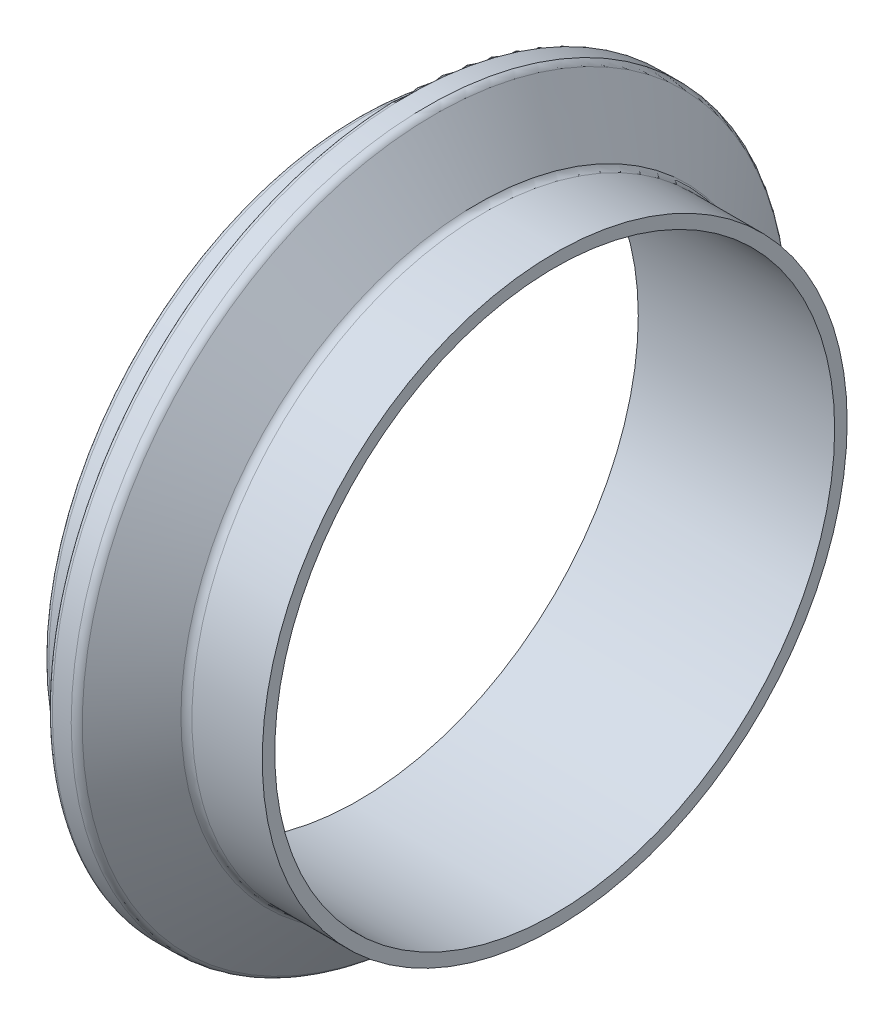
ISO-10303-21;
HEADER;
FILE_DESCRIPTION(('STEP AP214'),'2;1');
FILE_NAME('part.step','',(''),(''),'','','');
FILE_SCHEMA(('AUTOMOTIVE_DESIGN { 1 0 10303 214 1 1 1 1 }'));
ENDSEC;
DATA;
#1=APPLICATION_CONTEXT('core data for automotive mechanical design processes');
#2=APPLICATION_PROTOCOL_DEFINITION('international standard','automotive_design',2000,#1);
#3=PRODUCT_CONTEXT('',#1,'mechanical');
#4=PRODUCT('Part','Part','',(#3));
#5=PRODUCT_RELATED_PRODUCT_CATEGORY('part','',(#4));
#6=PRODUCT_DEFINITION_FORMATION('','',#4);
#7=PRODUCT_DEFINITION_CONTEXT('part definition',#1,'design');
#8=PRODUCT_DEFINITION('design','',#6,#7);
#9=PRODUCT_DEFINITION_SHAPE('','',#8);
#10=(LENGTH_UNIT() NAMED_UNIT(*) SI_UNIT(.MILLI.,.METRE.));
#11=(NAMED_UNIT(*) PLANE_ANGLE_UNIT() SI_UNIT($,.RADIAN.));
#12=(NAMED_UNIT(*) SI_UNIT($,.STERADIAN.) SOLID_ANGLE_UNIT());
#13=UNCERTAINTY_MEASURE_WITH_UNIT(LENGTH_MEASURE(1.E-05),#10,'distance_accuracy_value','');
#14=(GEOMETRIC_REPRESENTATION_CONTEXT(3) GLOBAL_UNCERTAINTY_ASSIGNED_CONTEXT((#13)) GLOBAL_UNIT_ASSIGNED_CONTEXT((#10,
#11,#12)) REPRESENTATION_CONTEXT('',''));
#15=CARTESIAN_POINT('',(0.,0.,0.));
#16=DIRECTION('',(0.,0.,1.));
#17=DIRECTION('',(1.,0.,0.));
#18=AXIS2_PLACEMENT_3D('',#15,#16,#17);
#19=CARTESIAN_POINT('',(0.,50.8,0.));
#20=DIRECTION('',(1.,0.,0.));
#21=DIRECTION('',(0.,0.,-1.));
#22=AXIS2_PLACEMENT_3D('',#19,#20,#21);
#23=PLANE('',#22);
#24=CARTESIAN_POINT('',(0.,0.,0.));
#25=DIRECTION('',(1.,0.,0.));
#26=DIRECTION('',(0.,0.,-1.));
#27=AXIS2_PLACEMENT_3D('',#24,#25,#26);
#28=CIRCLE('',#27,50.8);
#29=CARTESIAN_POINT('',(0.,0.,-50.8));
#30=VERTEX_POINT('',#29);
#31=EDGE_CURVE('E10',#30,#30,#28,.T.);
#32=ORIENTED_EDGE('',*,*,#31,.T.);
#33=EDGE_LOOP('',(#32));
#34=FACE_BOUND('',#33,.T.);
#35=CARTESIAN_POINT('',(0.,0.,0.));
#36=DIRECTION('',(1.,0.,0.));
#37=DIRECTION('',(0.,0.,-1.));
#38=AXIS2_PLACEMENT_3D('',#35,#36,#37);
#39=CIRCLE('',#38,48.6283);
#40=CARTESIAN_POINT('',(0.,0.,-48.6283));
#41=VERTEX_POINT('',#40);
#42=EDGE_CURVE('E74',#41,#41,#39,.T.);
#43=ORIENTED_EDGE('',*,*,#42,.F.);
#44=EDGE_LOOP('',(#43));
#45=FACE_BOUND('',#44,.T.);
#46=ADVANCED_FACE('F31',(#34,#45),#23,.T.);
#47=CARTESIAN_POINT('',(0.,0.,0.));
#48=DIRECTION('',(1.,0.,0.));
#49=DIRECTION('',(0.,0.,-1.));
#50=AXIS2_PLACEMENT_3D('',#47,#48,#49);
#51=CYLINDRICAL_SURFACE('',#50,50.8);
#52=CARTESIAN_POINT('',(-12.2121510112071,0.,0.));
#53=DIRECTION('',(1.,0.,0.));
#54=DIRECTION('',(0.,0.,-1.));
#55=AXIS2_PLACEMENT_3D('',#52,#53,#54);
#56=CIRCLE('',#55,50.8);
#57=CARTESIAN_POINT('',(-12.2121510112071,0.,-50.8));
#58=VERTEX_POINT('',#57);
#59=EDGE_CURVE('E37',#58,#58,#56,.T.);
#60=ORIENTED_EDGE('',*,*,#59,.T.);
#61=EDGE_LOOP('',(#60));
#62=FACE_BOUND('',#61,.T.);
#63=ORIENTED_EDGE('',*,*,#31,.F.);
#64=EDGE_LOOP('',(#63));
#65=FACE_BOUND('',#64,.T.);
#66=ADVANCED_FACE('F82',(#62,#65),#51,.T.);
#67=CARTESIAN_POINT('',(-12.2121510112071,0.,0.));
#68=DIRECTION('',(1.,0.,0.));
#69=DIRECTION('',(0.,0.,-1.));
#70=AXIS2_PLACEMENT_3D('',#67,#68,#69);
#71=TOROIDAL_SURFACE('',#70,52.4002,1.6002);
#72=CARTESIAN_POINT('',(-13.4901275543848,0.,0.));
#73=DIRECTION('',(1.,0.,0.));
#74=DIRECTION('',(0.,0.,-1.));
#75=AXIS2_PLACEMENT_3D('',#72,#73,#74);
#76=CIRCLE('',#75,51.4371755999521);
#77=CARTESIAN_POINT('',(-13.4901275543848,0.,-51.4371755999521));
#78=VERTEX_POINT('',#77);
#79=EDGE_CURVE('E41',#78,#78,#76,.T.);
#80=ORIENTED_EDGE('',*,*,#79,.T.);
#81=EDGE_LOOP('',(#80));
#82=FACE_BOUND('',#81,.T.);
#83=ORIENTED_EDGE('',*,*,#59,.F.);
#84=EDGE_LOOP('',(#83));
#85=FACE_BOUND('',#84,.T.);
#86=ADVANCED_FACE('F86',(#82,#85),#71,.F.);
#87=CARTESIAN_POINT('',(-13.4901275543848,0.,0.));
#88=DIRECTION('',(-1.,0.,0.));
#89=DIRECTION('',(0.,0.,1.));
#90=AXIS2_PLACEMENT_3D('',#87,#88,#89);
#91=CONICAL_SURFACE('',#90,51.4371755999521,0.925024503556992);
#92=CARTESIAN_POINT('',(-20.8558537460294,0.,0.));
#93=DIRECTION('',(1.,0.,0.));
#94=DIRECTION('',(0.,0.,-1.));
#95=AXIS2_PLACEMENT_3D('',#92,#93,#94);
#96=CIRCLE('',#95,61.2118244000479);
#97=CARTESIAN_POINT('',(-20.8558537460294,0.,-61.2118244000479));
#98=VERTEX_POINT('',#97);
#99=EDGE_CURVE('E45',#98,#98,#96,.T.);
#100=ORIENTED_EDGE('',*,*,#99,.T.);
#101=EDGE_LOOP('',(#100));
#102=FACE_BOUND('',#101,.T.);
#103=ORIENTED_EDGE('',*,*,#79,.F.);
#104=EDGE_LOOP('',(#103));
#105=FACE_BOUND('',#104,.T.);
#106=ADVANCED_FACE('F90',(#102,#105),#91,.T.);
#107=CARTESIAN_POINT('',(-22.1338302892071,0.,0.));
#108=DIRECTION('',(1.,0.,0.));
#109=DIRECTION('',(0.,0.,-1.));
#110=AXIS2_PLACEMENT_3D('',#107,#108,#109);
#111=TOROIDAL_SURFACE('',#110,60.2488,1.60020000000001);
#112=CARTESIAN_POINT('',(-22.1338302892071,0.,0.));
#113=DIRECTION('',(1.,0.,0.));
#114=DIRECTION('',(0.,0.,-1.));
#115=AXIS2_PLACEMENT_3D('',#112,#113,#114);
#116=CIRCLE('',#115,61.849);
#117=CARTESIAN_POINT('',(-22.1338302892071,0.,-61.849));
#118=VERTEX_POINT('',#117);
#119=EDGE_CURVE('E50',#118,#118,#116,.T.);
#120=ORIENTED_EDGE('',*,*,#119,.T.);
#121=EDGE_LOOP('',(#120));
#122=FACE_BOUND('',#121,.T.);
#123=ORIENTED_EDGE('',*,*,#99,.F.);
#124=EDGE_LOOP('',(#123));
#125=FACE_BOUND('',#124,.T.);
#126=ADVANCED_FACE('F97',(#122,#125),#111,.T.);
#127=CARTESIAN_POINT('',(0.,0.,0.));
#128=DIRECTION('',(1.,0.,0.));
#129=DIRECTION('',(0.,0.,-1.));
#130=AXIS2_PLACEMENT_3D('',#127,#128,#129);
#131=CYLINDRICAL_SURFACE('',#130,61.849);
#132=CARTESIAN_POINT('',(-25.4254,0.,0.));
#133=DIRECTION('',(1.,0.,0.));
#134=DIRECTION('',(0.,0.,-1.));
#135=AXIS2_PLACEMENT_3D('',#132,#133,#134);
#136=CIRCLE('',#135,61.849);
#137=CARTESIAN_POINT('',(-25.4254,0.,-61.849));
#138=VERTEX_POINT('',#137);
#139=EDGE_CURVE('E53',#138,#138,#136,.T.);
#140=ORIENTED_EDGE('',*,*,#139,.T.);
#141=EDGE_LOOP('',(#140));
#142=FACE_BOUND('',#141,.T.);
#143=ORIENTED_EDGE('',*,*,#119,.F.);
#144=EDGE_LOOP('',(#143));
#145=FACE_BOUND('',#144,.T.);
#146=ADVANCED_FACE('F101',(#142,#145),#131,.T.);
#147=CARTESIAN_POINT('',(-25.4254,0.,0.));
#148=DIRECTION('',(1.,0.,0.));
#149=DIRECTION('',(0.,0.,-1.));
#150=AXIS2_PLACEMENT_3D('',#147,#148,#149);
#151=TOROIDAL_SURFACE('',#150,61.0362,0.812799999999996);
#152=CARTESIAN_POINT('',(-26.2382,0.,0.));
#153=DIRECTION('',(1.,0.,0.));
#154=DIRECTION('',(0.,0.,-1.));
#155=AXIS2_PLACEMENT_3D('',#152,#153,#154);
#156=CIRCLE('',#155,61.0362);
#157=CARTESIAN_POINT('',(-26.2382,0.,-61.0362));
#158=VERTEX_POINT('',#157);
#159=EDGE_CURVE('E56',#158,#158,#156,.T.);
#160=ORIENTED_EDGE('',*,*,#159,.T.);
#161=EDGE_LOOP('',(#160));
#162=FACE_BOUND('',#161,.T.);
#163=ORIENTED_EDGE('',*,*,#139,.F.);
#164=EDGE_LOOP('',(#163));
#165=FACE_BOUND('',#164,.T.);
#166=ADVANCED_FACE('F105',(#162,#165),#151,.T.);
#167=CARTESIAN_POINT('',(-26.2382,55.3974,0.));
#168=DIRECTION('',(-1.,0.,0.));
#169=DIRECTION('',(0.,0.,1.));
#170=AXIS2_PLACEMENT_3D('',#167,#168,#169);
#171=PLANE('',#170);
#172=CARTESIAN_POINT('',(-26.2382,0.,0.));
#173=DIRECTION('',(1.,0.,0.));
#174=DIRECTION('',(0.,0.,-1.));
#175=AXIS2_PLACEMENT_3D('',#172,#173,#174);
#176=CIRCLE('',#175,55.3974);
#177=CARTESIAN_POINT('',(-26.2382,0.,-55.3974));
#178=VERTEX_POINT('',#177);
#179=EDGE_CURVE('E59',#178,#178,#176,.T.);
#180=ORIENTED_EDGE('',*,*,#179,.T.);
#181=EDGE_LOOP('',(#180));
#182=FACE_BOUND('',#181,.T.);
#183=ORIENTED_EDGE('',*,*,#159,.F.);
#184=EDGE_LOOP('',(#183));
#185=FACE_BOUND('',#184,.T.);
#186=ADVANCED_FACE('F109',(#182,#185),#171,.T.);
#187=CARTESIAN_POINT('',(-27.051,0.,0.));
#188=DIRECTION('',(1.,0.,0.));
#189=DIRECTION('',(0.,0.,-1.));
#190=AXIS2_PLACEMENT_3D('',#187,#188,#189);
#191=TOROIDAL_SURFACE('',#190,55.3974,0.812800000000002);
#192=CARTESIAN_POINT('',(-27.051,0.,0.));
#193=DIRECTION('',(1.,0.,0.));
#194=DIRECTION('',(0.,0.,-1.));
#195=AXIS2_PLACEMENT_3D('',#192,#193,#194);
#196=CIRCLE('',#195,54.5846);
#197=CARTESIAN_POINT('',(-27.051,0.,-54.5846));
#198=VERTEX_POINT('',#197);
#199=EDGE_CURVE('E62',#198,#198,#196,.T.);
#200=ORIENTED_EDGE('',*,*,#199,.T.);
#201=EDGE_LOOP('',(#200));
#202=FACE_BOUND('',#201,.T.);
#203=ORIENTED_EDGE('',*,*,#179,.F.);
#204=EDGE_LOOP('',(#203));
#205=FACE_BOUND('',#204,.T.);
#206=ADVANCED_FACE('F113',(#202,#205),#191,.F.);
#207=CARTESIAN_POINT('',(0.,0.,0.));
#208=DIRECTION('',(1.,0.,0.));
#209=DIRECTION('',(0.,0.,-1.));
#210=AXIS2_PLACEMENT_3D('',#207,#208,#209);
#211=CYLINDRICAL_SURFACE('',#210,54.5846);
#212=CARTESIAN_POINT('',(-33.2994,0.,0.));
#213=DIRECTION('',(1.,0.,0.));
#214=DIRECTION('',(0.,0.,-1.));
#215=AXIS2_PLACEMENT_3D('',#212,#213,#214);
#216=CIRCLE('',#215,54.5846);
#217=CARTESIAN_POINT('',(-33.2994,0.,-54.5846));
#218=VERTEX_POINT('',#217);
#219=EDGE_CURVE('E65',#218,#218,#216,.T.);
#220=ORIENTED_EDGE('',*,*,#219,.T.);
#221=EDGE_LOOP('',(#220));
#222=FACE_BOUND('',#221,.T.);
#223=ORIENTED_EDGE('',*,*,#199,.F.);
#224=EDGE_LOOP('',(#223));
#225=FACE_BOUND('',#224,.T.);
#226=ADVANCED_FACE('F117',(#222,#225),#211,.T.);
#227=CARTESIAN_POINT('',(-33.2994,0.,0.));
#228=DIRECTION('',(1.,0.,0.));
#229=DIRECTION('',(0.,0.,-1.));
#230=AXIS2_PLACEMENT_3D('',#227,#228,#229);
#231=TOROIDAL_SURFACE('',#230,53.7718,0.812800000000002);
#232=CARTESIAN_POINT('',(-34.1122,0.,0.));
#233=DIRECTION('',(1.,0.,0.));
#234=DIRECTION('',(0.,0.,-1.));
#235=AXIS2_PLACEMENT_3D('',#232,#233,#234);
#236=CIRCLE('',#235,53.7718);
#237=CARTESIAN_POINT('',(-34.1122,0.,-53.7718));
#238=VERTEX_POINT('',#237);
#239=EDGE_CURVE('E68',#238,#238,#236,.T.);
#240=ORIENTED_EDGE('',*,*,#239,.T.);
#241=EDGE_LOOP('',(#240));
#242=FACE_BOUND('',#241,.T.);
#243=ORIENTED_EDGE('',*,*,#219,.F.);
#244=EDGE_LOOP('',(#243));
#245=FACE_BOUND('',#244,.T.);
#246=ADVANCED_FACE('F121',(#242,#245),#231,.T.);
#247=CARTESIAN_POINT('',(-34.1122,48.6283,0.));
#248=DIRECTION('',(-1.,0.,0.));
#249=DIRECTION('',(0.,0.,1.));
#250=AXIS2_PLACEMENT_3D('',#247,#248,#249);
#251=PLANE('',#250);
#252=CARTESIAN_POINT('',(-34.1122,0.,0.));
#253=DIRECTION('',(1.,0.,0.));
#254=DIRECTION('',(0.,0.,-1.));
#255=AXIS2_PLACEMENT_3D('',#252,#253,#254);
#256=CIRCLE('',#255,48.6283);
#257=CARTESIAN_POINT('',(-34.1122,0.,-48.6283));
#258=VERTEX_POINT('',#257);
#259=EDGE_CURVE('E71',#258,#258,#256,.T.);
#260=ORIENTED_EDGE('',*,*,#259,.T.);
#261=EDGE_LOOP('',(#260));
#262=FACE_BOUND('',#261,.T.);
#263=ORIENTED_EDGE('',*,*,#239,.F.);
#264=EDGE_LOOP('',(#263));
#265=FACE_BOUND('',#264,.T.);
#266=ADVANCED_FACE('F125',(#262,#265),#251,.T.);
#267=CARTESIAN_POINT('',(0.,0.,0.));
#268=DIRECTION('',(1.,0.,0.));
#269=DIRECTION('',(0.,0.,-1.));
#270=AXIS2_PLACEMENT_3D('',#267,#268,#269);
#271=CYLINDRICAL_SURFACE('',#270,48.6283);
#272=ORIENTED_EDGE('',*,*,#42,.T.);
#273=EDGE_LOOP('',(#272));
#274=FACE_BOUND('',#273,.T.);
#275=ORIENTED_EDGE('',*,*,#259,.F.);
#276=EDGE_LOOP('',(#275));
#277=FACE_BOUND('',#276,.T.);
#278=ADVANCED_FACE('F78',(#274,#277),#271,.F.);
#279=CLOSED_SHELL('',(#46,#66,#86,#106,#126,#146,#166,#186,#206,#226,#246,#266,#278));
#280=MANIFOLD_SOLID_BREP('B2',#279);
#281=ADVANCED_BREP_SHAPE_REPRESENTATION('',(#18,#280),#14);
#282=SHAPE_DEFINITION_REPRESENTATION(#9,#281);
ENDSEC;
END-ISO-10303-21;
